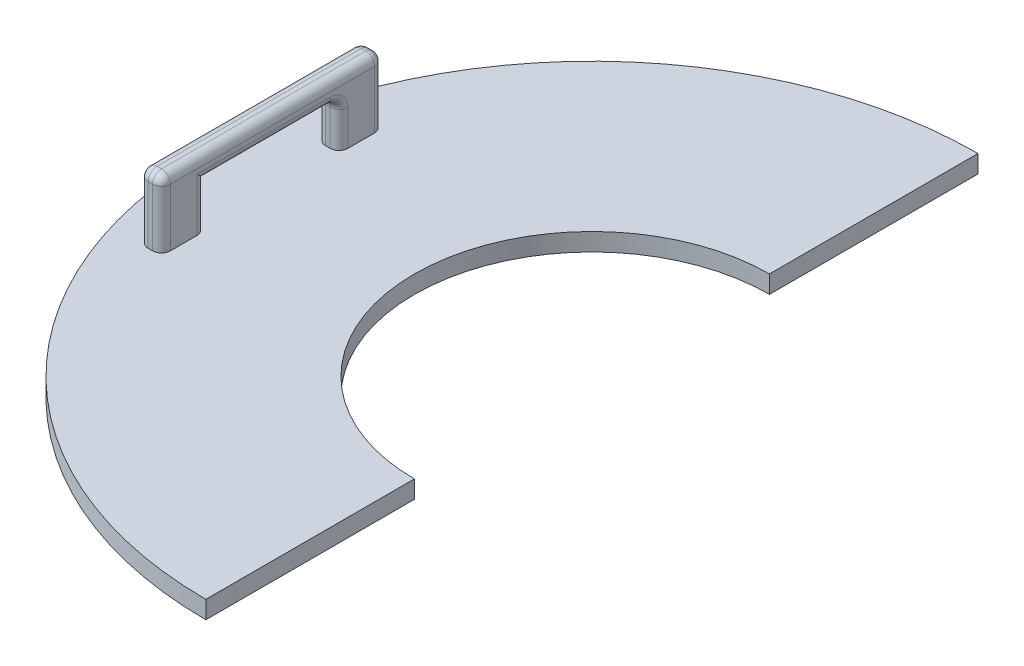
ISO-10303-21;
HEADER;
FILE_DESCRIPTION(('STEP AP214'),'2;1');
FILE_NAME('part.step','',(''),(''),'','','');
FILE_SCHEMA(('AUTOMOTIVE_DESIGN { 1 0 10303 214 1 1 1 1 }'));
ENDSEC;
DATA;
#1=APPLICATION_CONTEXT('core data for automotive mechanical design processes');
#2=APPLICATION_PROTOCOL_DEFINITION('international standard','automotive_design',2000,#1);
#3=PRODUCT_CONTEXT('',#1,'mechanical');
#4=PRODUCT('Part','Part','',(#3));
#5=PRODUCT_RELATED_PRODUCT_CATEGORY('part','',(#4));
#6=PRODUCT_DEFINITION_FORMATION('','',#4);
#7=PRODUCT_DEFINITION_CONTEXT('part definition',#1,'design');
#8=PRODUCT_DEFINITION('design','',#6,#7);
#9=PRODUCT_DEFINITION_SHAPE('','',#8);
#10=(LENGTH_UNIT() NAMED_UNIT(*) SI_UNIT(.MILLI.,.METRE.));
#11=(NAMED_UNIT(*) PLANE_ANGLE_UNIT() SI_UNIT($,.RADIAN.));
#12=(NAMED_UNIT(*) SI_UNIT($,.STERADIAN.) SOLID_ANGLE_UNIT());
#13=UNCERTAINTY_MEASURE_WITH_UNIT(LENGTH_MEASURE(1.E-05),#10,'distance_accuracy_value','');
#14=(GEOMETRIC_REPRESENTATION_CONTEXT(3) GLOBAL_UNCERTAINTY_ASSIGNED_CONTEXT((#13)) GLOBAL_UNIT_ASSIGNED_CONTEXT((#10,
#11,#12)) REPRESENTATION_CONTEXT('',''));
#15=CARTESIAN_POINT('',(0.,0.,0.));
#16=DIRECTION('',(0.,0.,1.));
#17=DIRECTION('',(1.,0.,0.));
#18=AXIS2_PLACEMENT_3D('',#15,#16,#17);
#19=CARTESIAN_POINT('',(-77.,19.,15.));
#20=DIRECTION('',(0.,0.,1.));
#21=DIRECTION('',(1.,0.,0.));
#22=AXIS2_PLACEMENT_3D('',#19,#20,#21);
#23=PLANE('',#22);
#24=DIRECTION('',(-1.,0.,0.));
#25=VECTOR('',#24,1.);
#26=CARTESIAN_POINT('',(-77.,4.,15.));
#27=LINE('',#26,#25);
#28=CARTESIAN_POINT('',(-74.,4.,15.));
#29=VERTEX_POINT('',#28);
#30=CARTESIAN_POINT('',(-75.,4.,15.));
#31=VERTEX_POINT('',#30);
#32=EDGE_CURVE('E417',#29,#31,#27,.T.);
#33=ORIENTED_EDGE('',*,*,#32,.T.);
#34=DIRECTION('',(0.,-1.,0.));
#35=VECTOR('',#34,1.);
#36=CARTESIAN_POINT('',(-75.,19.,15.));
#37=LINE('',#36,#35);
#38=CARTESIAN_POINT('',(-75.,14.,14.9999999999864));
#39=VERTEX_POINT('',#38);
#40=EDGE_CURVE('E273',#31,#39,#37,.F.);
#41=ORIENTED_EDGE('',*,*,#40,.T.);
#42=DIRECTION('',(1.,0.,0.));
#43=VECTOR('',#42,1.);
#44=CARTESIAN_POINT('',(-77.,14.,14.9999999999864));
#45=LINE('',#44,#43);
#46=CARTESIAN_POINT('',(-74.,14.,14.9999999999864));
#47=VERTEX_POINT('',#46);
#48=EDGE_CURVE('E330',#39,#47,#45,.T.);
#49=ORIENTED_EDGE('',*,*,#48,.T.);
#50=DIRECTION('',(0.,-1.,0.));
#51=VECTOR('',#50,1.);
#52=CARTESIAN_POINT('',(-74.,19.,15.));
#53=LINE('',#52,#51);
#54=EDGE_CURVE('E271',#47,#29,#53,.T.);
#55=ORIENTED_EDGE('',*,*,#54,.T.);
#56=EDGE_LOOP('',(#33,#41,#49,#55));
#57=FACE_BOUND('',#56,.T.);
#58=ADVANCED_FACE('F34',(#57),#23,.F.);
#59=CARTESIAN_POINT('',(-77.,19.,-15.));
#60=DIRECTION('',(0.,0.,-1.));
#61=DIRECTION('',(-1.,0.,0.));
#62=AXIS2_PLACEMENT_3D('',#59,#60,#61);
#63=PLANE('',#62);
#64=DIRECTION('',(1.,0.,0.));
#65=VECTOR('',#64,1.);
#66=CARTESIAN_POINT('',(-77.,12.,-15.));
#67=LINE('',#66,#65);
#68=CARTESIAN_POINT('',(-74.,12.,-15.));
#69=VERTEX_POINT('',#68);
#70=CARTESIAN_POINT('',(-75.,12.,-15.));
#71=VERTEX_POINT('',#70);
#72=EDGE_CURVE('E250',#69,#71,#67,.F.);
#73=ORIENTED_EDGE('',*,*,#72,.T.);
#74=DIRECTION('',(0.,-1.,0.));
#75=VECTOR('',#74,1.);
#76=CARTESIAN_POINT('',(-75.,19.,-15.));
#77=LINE('',#76,#75);
#78=CARTESIAN_POINT('',(-75.,4.,-15.));
#79=VERTEX_POINT('',#78);
#80=EDGE_CURVE('E254',#71,#79,#77,.T.);
#81=ORIENTED_EDGE('',*,*,#80,.T.);
#82=DIRECTION('',(1.,0.,0.));
#83=VECTOR('',#82,1.);
#84=CARTESIAN_POINT('',(-77.,4.,-15.));
#85=LINE('',#84,#83);
#86=CARTESIAN_POINT('',(-74.,4.,-15.));
#87=VERTEX_POINT('',#86);
#88=EDGE_CURVE('E408',#79,#87,#85,.T.);
#89=ORIENTED_EDGE('',*,*,#88,.T.);
#90=DIRECTION('',(0.,-1.,0.));
#91=VECTOR('',#90,1.);
#92=CARTESIAN_POINT('',(-74.,19.,-15.));
#93=LINE('',#92,#91);
#94=EDGE_CURVE('E252',#87,#69,#93,.F.);
#95=ORIENTED_EDGE('',*,*,#94,.T.);
#96=EDGE_LOOP('',(#73,#81,#89,#95));
#97=FACE_BOUND('',#96,.T.);
#98=ADVANCED_FACE('F448',(#97),#63,.F.);
#99=CARTESIAN_POINT('',(0.,4.,0.));
#100=DIRECTION('',(0.,1.,0.));
#101=DIRECTION('',(0.,0.,1.));
#102=AXIS2_PLACEMENT_3D('',#99,#100,#101);
#103=PLANE('',#102);
#104=CARTESIAN_POINT('',(0.,4.,0.));
#105=DIRECTION('',(0.,-1.,0.));
#106=DIRECTION('',(0.,0.,1.));
#107=AXIS2_PLACEMENT_3D('',#104,#105,#106);
#108=CIRCLE('',#107,40.);
#109=CARTESIAN_POINT('',(0.,4.,40.));
#110=VERTEX_POINT('',#109);
#111=CARTESIAN_POINT('',(0.,4.,-40.));
#112=VERTEX_POINT('',#111);
#113=EDGE_CURVE('E207',#110,#112,#108,.T.);
#114=ORIENTED_EDGE('',*,*,#113,.T.);
#115=DIRECTION('',(0.,0.,-1.));
#116=VECTOR('',#115,1.);
#117=CARTESIAN_POINT('',(0.,4.,-87.));
#118=LINE('',#117,#116);
#119=CARTESIAN_POINT('',(0.,4.,-87.));
#120=VERTEX_POINT('',#119);
#121=EDGE_CURVE('E196',#112,#120,#118,.T.);
#122=ORIENTED_EDGE('',*,*,#121,.T.);
#123=CARTESIAN_POINT('',(0.,4.,0.));
#124=DIRECTION('',(0.,1.,0.));
#125=DIRECTION('',(0.,0.,1.));
#126=AXIS2_PLACEMENT_3D('',#123,#124,#125);
#127=CIRCLE('',#126,87.);
#128=CARTESIAN_POINT('',(0.,4.,87.));
#129=VERTEX_POINT('',#128);
#130=EDGE_CURVE('E206',#120,#129,#127,.T.);
#131=ORIENTED_EDGE('',*,*,#130,.T.);
#132=DIRECTION('',(0.,0.,-1.));
#133=VECTOR('',#132,1.);
#134=CARTESIAN_POINT('',(0.,4.,40.));
#135=LINE('',#134,#133);
#136=EDGE_CURVE('E213',#129,#110,#135,.T.);
#137=ORIENTED_EDGE('',*,*,#136,.T.);
#138=EDGE_LOOP('',(#114,#122,#131,#137));
#139=FACE_BOUND('',#138,.T.);
#140=DIRECTION('',(1.,0.,0.));
#141=VECTOR('',#140,1.);
#142=CARTESIAN_POINT('',(-77.,4.,25.));
#143=LINE('',#142,#141);
#144=CARTESIAN_POINT('',(-75.,4.,25.));
#145=VERTEX_POINT('',#144);
#146=CARTESIAN_POINT('',(-74.,4.,25.));
#147=VERTEX_POINT('',#146);
#148=EDGE_CURVE('E405',#145,#147,#143,.T.);
#149=ORIENTED_EDGE('',*,*,#148,.F.);
#150=CARTESIAN_POINT('',(-75.,4.,23.));
#151=DIRECTION('',(0.,1.,0.));
#152=DIRECTION('',(0.,0.,1.));
#153=AXIS2_PLACEMENT_3D('',#150,#151,#152);
#154=CIRCLE('',#153,2.);
#155=CARTESIAN_POINT('',(-77.,4.,23.));
#156=VERTEX_POINT('',#155);
#157=EDGE_CURVE('E11',#145,#156,#154,.F.);
#158=ORIENTED_EDGE('',*,*,#157,.T.);
#159=DIRECTION('',(0.,0.,1.));
#160=VECTOR('',#159,1.);
#161=CARTESIAN_POINT('',(-77.,4.,25.));
#162=LINE('',#161,#160);
#163=CARTESIAN_POINT('',(-77.,4.,17.));
#164=VERTEX_POINT('',#163);
#165=EDGE_CURVE('E402',#164,#156,#162,.T.);
#166=ORIENTED_EDGE('',*,*,#165,.F.);
#167=CARTESIAN_POINT('',(-75.,4.,17.));
#168=DIRECTION('',(0.,1.,0.));
#169=DIRECTION('',(0.,0.,1.));
#170=AXIS2_PLACEMENT_3D('',#167,#168,#169);
#171=CIRCLE('',#170,2.);
#172=EDGE_CURVE('E296',#164,#31,#171,.F.);
#173=ORIENTED_EDGE('',*,*,#172,.T.);
#174=ORIENTED_EDGE('',*,*,#32,.F.);
#175=CARTESIAN_POINT('',(-74.,4.,17.));
#176=DIRECTION('',(0.,1.,0.));
#177=DIRECTION('',(0.,0.,1.));
#178=AXIS2_PLACEMENT_3D('',#175,#176,#177);
#179=CIRCLE('',#178,2.);
#180=CARTESIAN_POINT('',(-72.,4.,17.));
#181=VERTEX_POINT('',#180);
#182=EDGE_CURVE('E298',#29,#181,#179,.F.);
#183=ORIENTED_EDGE('',*,*,#182,.T.);
#184=DIRECTION('',(0.,0.,-1.));
#185=VECTOR('',#184,1.);
#186=CARTESIAN_POINT('',(-72.,4.,25.));
#187=LINE('',#186,#185);
#188=CARTESIAN_POINT('',(-72.,4.,23.));
#189=VERTEX_POINT('',#188);
#190=EDGE_CURVE('E414',#189,#181,#187,.T.);
#191=ORIENTED_EDGE('',*,*,#190,.F.);
#192=CARTESIAN_POINT('',(-74.,4.,23.));
#193=DIRECTION('',(0.,1.,0.));
#194=DIRECTION('',(0.,0.,1.));
#195=AXIS2_PLACEMENT_3D('',#192,#193,#194);
#196=CIRCLE('',#195,2.);
#197=EDGE_CURVE('E43',#189,#147,#196,.F.);
#198=ORIENTED_EDGE('',*,*,#197,.T.);
#199=EDGE_LOOP('',(#149,#158,#166,#173,#174,#183,#191,#198));
#200=FACE_BOUND('',#199,.T.);
#201=ORIENTED_EDGE('',*,*,#88,.F.);
#202=CARTESIAN_POINT('',(-75.,4.,-17.));
#203=DIRECTION('',(0.,1.,0.));
#204=DIRECTION('',(0.,0.,1.));
#205=AXIS2_PLACEMENT_3D('',#202,#203,#204);
#206=CIRCLE('',#205,2.);
#207=CARTESIAN_POINT('',(-77.,4.,-17.));
#208=VERTEX_POINT('',#207);
#209=EDGE_CURVE('E294',#79,#208,#206,.F.);
#210=ORIENTED_EDGE('',*,*,#209,.T.);
#211=DIRECTION('',(0.,0.,1.));
#212=VECTOR('',#211,1.);
#213=CARTESIAN_POINT('',(-77.,4.,-15.));
#214=LINE('',#213,#212);
#215=CARTESIAN_POINT('',(-77.,4.,-23.));
#216=VERTEX_POINT('',#215);
#217=EDGE_CURVE('E400',#216,#208,#214,.T.);
#218=ORIENTED_EDGE('',*,*,#217,.F.);
#219=CARTESIAN_POINT('',(-75.,4.,-23.));
#220=DIRECTION('',(0.,1.,0.));
#221=DIRECTION('',(0.,0.,1.));
#222=AXIS2_PLACEMENT_3D('',#219,#220,#221);
#223=CIRCLE('',#222,2.);
#224=CARTESIAN_POINT('',(-75.,4.,-25.));
#225=VERTEX_POINT('',#224);
#226=EDGE_CURVE('E304',#216,#225,#223,.F.);
#227=ORIENTED_EDGE('',*,*,#226,.T.);
#228=DIRECTION('',(-1.,0.,0.));
#229=VECTOR('',#228,1.);
#230=CARTESIAN_POINT('',(-77.,4.,-25.));
#231=LINE('',#230,#229);
#232=CARTESIAN_POINT('',(-74.,4.,-25.));
#233=VERTEX_POINT('',#232);
#234=EDGE_CURVE('E398',#233,#225,#231,.T.);
#235=ORIENTED_EDGE('',*,*,#234,.F.);
#236=CARTESIAN_POINT('',(-74.,4.,-23.));
#237=DIRECTION('',(0.,1.,0.));
#238=DIRECTION('',(0.,0.,1.));
#239=AXIS2_PLACEMENT_3D('',#236,#237,#238);
#240=CIRCLE('',#239,2.);
#241=CARTESIAN_POINT('',(-72.,4.,-23.));
#242=VERTEX_POINT('',#241);
#243=EDGE_CURVE('E302',#233,#242,#240,.F.);
#244=ORIENTED_EDGE('',*,*,#243,.T.);
#245=DIRECTION('',(0.,0.,-1.));
#246=VECTOR('',#245,1.);
#247=CARTESIAN_POINT('',(-72.,4.,-15.));
#248=LINE('',#247,#246);
#249=CARTESIAN_POINT('',(-72.,4.,-17.));
#250=VERTEX_POINT('',#249);
#251=EDGE_CURVE('E403',#250,#242,#248,.T.);
#252=ORIENTED_EDGE('',*,*,#251,.F.);
#253=CARTESIAN_POINT('',(-74.,4.,-17.));
#254=DIRECTION('',(0.,1.,0.));
#255=DIRECTION('',(0.,0.,1.));
#256=AXIS2_PLACEMENT_3D('',#253,#254,#255);
#257=CIRCLE('',#256,2.);
#258=EDGE_CURVE('E300',#250,#87,#257,.F.);
#259=ORIENTED_EDGE('',*,*,#258,.T.);
#260=EDGE_LOOP('',(#201,#210,#218,#227,#235,#244,#252,#259));
#261=FACE_BOUND('',#260,.T.);
#262=ADVANCED_FACE('F210',(#139,#200,#261),#103,.T.);
#263=CARTESIAN_POINT('',(0.,4.,0.));
#264=DIRECTION('',(0.,-1.,0.));
#265=DIRECTION('',(0.,0.,-1.));
#266=AXIS2_PLACEMENT_3D('',#263,#264,#265);
#267=CYLINDRICAL_SURFACE('',#266,40.);
#268=CARTESIAN_POINT('',(0.,0.,0.));
#269=DIRECTION('',(0.,-1.,0.));
#270=DIRECTION('',(0.,0.,1.));
#271=AXIS2_PLACEMENT_3D('',#268,#269,#270);
#272=CIRCLE('',#271,40.);
#273=CARTESIAN_POINT('',(0.,0.,40.));
#274=VERTEX_POINT('',#273);
#275=CARTESIAN_POINT('',(0.,0.,-40.));
#276=VERTEX_POINT('',#275);
#277=EDGE_CURVE('E221',#274,#276,#272,.T.);
#278=ORIENTED_EDGE('',*,*,#277,.T.);
#279=DIRECTION('',(0.,-1.,0.));
#280=VECTOR('',#279,1.);
#281=CARTESIAN_POINT('',(0.,4.,-40.));
#282=LINE('',#281,#280);
#283=EDGE_CURVE('E200',#112,#276,#282,.T.);
#284=ORIENTED_EDGE('',*,*,#283,.F.);
#285=ORIENTED_EDGE('',*,*,#113,.F.);
#286=DIRECTION('',(0.,-1.,0.));
#287=VECTOR('',#286,1.);
#288=CARTESIAN_POINT('',(0.,4.,40.));
#289=LINE('',#288,#287);
#290=EDGE_CURVE('E422',#110,#274,#289,.T.);
#291=ORIENTED_EDGE('',*,*,#290,.T.);
#292=EDGE_LOOP('',(#278,#284,#285,#291));
#293=FACE_BOUND('',#292,.T.);
#294=ADVANCED_FACE('F219',(#293),#267,.F.);
#295=CARTESIAN_POINT('',(0.,4.,-87.));
#296=DIRECTION('',(-1.,0.,0.));
#297=DIRECTION('',(0.,0.,1.));
#298=AXIS2_PLACEMENT_3D('',#295,#296,#297);
#299=PLANE('',#298);
#300=DIRECTION('',(0.,0.,-1.));
#301=VECTOR('',#300,1.);
#302=CARTESIAN_POINT('',(0.,0.,-87.));
#303=LINE('',#302,#301);
#304=CARTESIAN_POINT('',(0.,0.,-87.));
#305=VERTEX_POINT('',#304);
#306=EDGE_CURVE('E424',#276,#305,#303,.T.);
#307=ORIENTED_EDGE('',*,*,#306,.T.);
#308=DIRECTION('',(0.,-1.,0.));
#309=VECTOR('',#308,1.);
#310=CARTESIAN_POINT('',(0.,4.,-87.));
#311=LINE('',#310,#309);
#312=EDGE_CURVE('E203',#120,#305,#311,.T.);
#313=ORIENTED_EDGE('',*,*,#312,.F.);
#314=ORIENTED_EDGE('',*,*,#121,.F.);
#315=ORIENTED_EDGE('',*,*,#283,.T.);
#316=EDGE_LOOP('',(#307,#313,#314,#315));
#317=FACE_BOUND('',#316,.T.);
#318=ADVANCED_FACE('F198',(#317),#299,.F.);
#319=CARTESIAN_POINT('',(0.,4.,0.));
#320=DIRECTION('',(0.,-1.,0.));
#321=DIRECTION('',(0.,0.,-1.));
#322=AXIS2_PLACEMENT_3D('',#319,#320,#321);
#323=CYLINDRICAL_SURFACE('',#322,87.);
#324=CARTESIAN_POINT('',(0.,0.,0.));
#325=DIRECTION('',(0.,1.,0.));
#326=DIRECTION('',(0.,0.,1.));
#327=AXIS2_PLACEMENT_3D('',#324,#325,#326);
#328=CIRCLE('',#327,87.);
#329=CARTESIAN_POINT('',(0.,0.,87.));
#330=VERTEX_POINT('',#329);
#331=EDGE_CURVE('E426',#305,#330,#328,.T.);
#332=ORIENTED_EDGE('',*,*,#331,.T.);
#333=DIRECTION('',(0.,-1.,0.));
#334=VECTOR('',#333,1.);
#335=CARTESIAN_POINT('',(0.,4.,87.));
#336=LINE('',#335,#334);
#337=EDGE_CURVE('E226',#129,#330,#336,.T.);
#338=ORIENTED_EDGE('',*,*,#337,.F.);
#339=ORIENTED_EDGE('',*,*,#130,.F.);
#340=ORIENTED_EDGE('',*,*,#312,.T.);
#341=EDGE_LOOP('',(#332,#338,#339,#340));
#342=FACE_BOUND('',#341,.T.);
#343=ADVANCED_FACE('F438',(#342),#323,.T.);
#344=CARTESIAN_POINT('',(0.,4.,40.));
#345=DIRECTION('',(-1.,0.,0.));
#346=DIRECTION('',(0.,0.,1.));
#347=AXIS2_PLACEMENT_3D('',#344,#345,#346);
#348=PLANE('',#347);
#349=DIRECTION('',(0.,0.,-1.));
#350=VECTOR('',#349,1.);
#351=CARTESIAN_POINT('',(0.,0.,40.));
#352=LINE('',#351,#350);
#353=EDGE_CURVE('E217',#330,#274,#352,.T.);
#354=ORIENTED_EDGE('',*,*,#353,.T.);
#355=ORIENTED_EDGE('',*,*,#290,.F.);
#356=ORIENTED_EDGE('',*,*,#136,.F.);
#357=ORIENTED_EDGE('',*,*,#337,.T.);
#358=EDGE_LOOP('',(#354,#355,#356,#357));
#359=FACE_BOUND('',#358,.T.);
#360=ADVANCED_FACE('F433',(#359),#348,.F.);
#361=CARTESIAN_POINT('',(0.,0.,0.));
#362=DIRECTION('',(0.,1.,0.));
#363=DIRECTION('',(0.,0.,1.));
#364=AXIS2_PLACEMENT_3D('',#361,#362,#363);
#365=PLANE('',#364);
#366=ORIENTED_EDGE('',*,*,#277,.F.);
#367=ORIENTED_EDGE('',*,*,#353,.F.);
#368=ORIENTED_EDGE('',*,*,#331,.F.);
#369=ORIENTED_EDGE('',*,*,#306,.F.);
#370=EDGE_LOOP('',(#366,#367,#368,#369));
#371=FACE_BOUND('',#370,.T.);
#372=ADVANCED_FACE('F437',(#371),#365,.F.);
#373=CARTESIAN_POINT('',(-77.,19.,25.));
#374=DIRECTION('',(1.,0.,0.));
#375=DIRECTION('',(0.,0.,-1.));
#376=AXIS2_PLACEMENT_3D('',#373,#374,#375);
#377=PLANE('',#376);
#378=ORIENTED_EDGE('',*,*,#217,.T.);
#379=DIRECTION('',(0.,-1.,0.));
#380=VECTOR('',#379,1.);
#381=CARTESIAN_POINT('',(-77.,19.,-17.));
#382=LINE('',#381,#380);
#383=CARTESIAN_POINT('',(-77.,12.,-17.));
#384=VERTEX_POINT('',#383);
#385=EDGE_CURVE('E269',#208,#384,#382,.F.);
#386=ORIENTED_EDGE('',*,*,#385,.T.);
#387=CARTESIAN_POINT('',(-77.,12.,-12.9999999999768));
#388=DIRECTION('',(1.,0.,0.));
#389=DIRECTION('',(0.,0.,-1.));
#390=AXIS2_PLACEMENT_3D('',#387,#388,#389);
#391=CIRCLE('',#390,4.);
#392=CARTESIAN_POINT('',(-77.,16.,-12.9999999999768));
#393=VERTEX_POINT('',#392);
#394=EDGE_CURVE('E266',#393,#384,#391,.F.);
#395=ORIENTED_EDGE('',*,*,#394,.F.);
#396=DIRECTION('',(0.,0.,-1.));
#397=VECTOR('',#396,1.);
#398=CARTESIAN_POINT('',(-77.,16.,25.));
#399=LINE('',#398,#397);
#400=CARTESIAN_POINT('',(-77.,16.,17.));
#401=VERTEX_POINT('',#400);
#402=EDGE_CURVE('E262',#393,#401,#399,.F.);
#403=ORIENTED_EDGE('',*,*,#402,.T.);
#404=DIRECTION('',(0.,-1.,0.));
#405=VECTOR('',#404,1.);
#406=CARTESIAN_POINT('',(-77.,19.,17.));
#407=LINE('',#406,#405);
#408=EDGE_CURVE('E264',#401,#164,#407,.T.);
#409=ORIENTED_EDGE('',*,*,#408,.T.);
#410=ORIENTED_EDGE('',*,*,#165,.T.);
#411=DIRECTION('',(0.,-1.,0.));
#412=VECTOR('',#411,1.);
#413=CARTESIAN_POINT('',(-77.,19.,23.));
#414=LINE('',#413,#412);
#415=CARTESIAN_POINT('',(-77.,17.,23.));
#416=VERTEX_POINT('',#415);
#417=EDGE_CURVE('E256',#156,#416,#414,.F.);
#418=ORIENTED_EDGE('',*,*,#417,.T.);
#419=DIRECTION('',(0.,0.,1.));
#420=VECTOR('',#419,1.);
#421=CARTESIAN_POINT('',(-77.,17.,25.));
#422=LINE('',#421,#420);
#423=CARTESIAN_POINT('',(-77.,17.,-23.));
#424=VERTEX_POINT('',#423);
#425=EDGE_CURVE('E258',#416,#424,#422,.F.);
#426=ORIENTED_EDGE('',*,*,#425,.T.);
#427=DIRECTION('',(0.,-1.,0.));
#428=VECTOR('',#427,1.);
#429=CARTESIAN_POINT('',(-77.,19.,-23.));
#430=LINE('',#429,#428);
#431=EDGE_CURVE('E260',#424,#216,#430,.T.);
#432=ORIENTED_EDGE('',*,*,#431,.T.);
#433=EDGE_LOOP('',(#378,#386,#395,#403,#409,#410,#418,#426,#432));
#434=FACE_BOUND('',#433,.T.);
#435=ADVANCED_FACE('F388',(#434),#377,.F.);
#436=CARTESIAN_POINT('',(-77.,19.,25.));
#437=DIRECTION('',(0.,0.,-1.));
#438=DIRECTION('',(-1.,0.,0.));
#439=AXIS2_PLACEMENT_3D('',#436,#437,#438);
#440=PLANE('',#439);
#441=ORIENTED_EDGE('',*,*,#148,.T.);
#442=DIRECTION('',(0.,-1.,0.));
#443=VECTOR('',#442,1.);
#444=CARTESIAN_POINT('',(-74.,19.,25.));
#445=LINE('',#444,#443);
#446=CARTESIAN_POINT('',(-74.,17.,25.));
#447=VERTEX_POINT('',#446);
#448=EDGE_CURVE('E288',#147,#447,#445,.F.);
#449=ORIENTED_EDGE('',*,*,#448,.T.);
#450=DIRECTION('',(1.,0.,0.));
#451=VECTOR('',#450,1.);
#452=CARTESIAN_POINT('',(-77.,17.,25.));
#453=LINE('',#452,#451);
#454=CARTESIAN_POINT('',(-75.,17.,25.));
#455=VERTEX_POINT('',#454);
#456=EDGE_CURVE('E286',#447,#455,#453,.F.);
#457=ORIENTED_EDGE('',*,*,#456,.T.);
#458=DIRECTION('',(0.,-1.,0.));
#459=VECTOR('',#458,1.);
#460=CARTESIAN_POINT('',(-75.,19.,25.));
#461=LINE('',#460,#459);
#462=EDGE_CURVE('E284',#455,#145,#461,.T.);
#463=ORIENTED_EDGE('',*,*,#462,.T.);
#464=EDGE_LOOP('',(#441,#449,#457,#463));
#465=FACE_BOUND('',#464,.T.);
#466=ADVANCED_FACE('F461',(#465),#440,.F.);
#467=CARTESIAN_POINT('',(-72.,19.,25.));
#468=DIRECTION('',(-1.,0.,0.));
#469=DIRECTION('',(0.,0.,1.));
#470=AXIS2_PLACEMENT_3D('',#467,#468,#469);
#471=PLANE('',#470);
#472=ORIENTED_EDGE('',*,*,#190,.T.);
#473=DIRECTION('',(0.,-1.,0.));
#474=VECTOR('',#473,1.);
#475=CARTESIAN_POINT('',(-72.,19.,17.));
#476=LINE('',#475,#474);
#477=CARTESIAN_POINT('',(-72.,16.,17.));
#478=VERTEX_POINT('',#477);
#479=EDGE_CURVE('E242',#181,#478,#476,.F.);
#480=ORIENTED_EDGE('',*,*,#479,.T.);
#481=DIRECTION('',(0.,0.,-1.));
#482=VECTOR('',#481,1.);
#483=CARTESIAN_POINT('',(-72.,16.,25.));
#484=LINE('',#483,#482);
#485=CARTESIAN_POINT('',(-72.,16.,-12.9999999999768));
#486=VERTEX_POINT('',#485);
#487=EDGE_CURVE('E239',#478,#486,#484,.T.);
#488=ORIENTED_EDGE('',*,*,#487,.T.);
#489=CARTESIAN_POINT('',(-72.,12.,-12.9999999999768));
#490=DIRECTION('',(-1.,0.,0.));
#491=DIRECTION('',(0.,0.,1.));
#492=AXIS2_PLACEMENT_3D('',#489,#490,#491);
#493=CIRCLE('',#492,4.);
#494=CARTESIAN_POINT('',(-72.,12.,-17.));
#495=VERTEX_POINT('',#494);
#496=EDGE_CURVE('E236',#495,#486,#493,.F.);
#497=ORIENTED_EDGE('',*,*,#496,.F.);
#498=DIRECTION('',(0.,-1.,0.));
#499=VECTOR('',#498,1.);
#500=CARTESIAN_POINT('',(-72.,19.,-17.));
#501=LINE('',#500,#499);
#502=EDGE_CURVE('E234',#495,#250,#501,.T.);
#503=ORIENTED_EDGE('',*,*,#502,.T.);
#504=ORIENTED_EDGE('',*,*,#251,.T.);
#505=DIRECTION('',(0.,-1.,0.));
#506=VECTOR('',#505,1.);
#507=CARTESIAN_POINT('',(-72.,19.,-23.));
#508=LINE('',#507,#506);
#509=CARTESIAN_POINT('',(-72.,17.,-23.));
#510=VERTEX_POINT('',#509);
#511=EDGE_CURVE('E232',#242,#510,#508,.F.);
#512=ORIENTED_EDGE('',*,*,#511,.T.);
#513=DIRECTION('',(0.,0.,-1.));
#514=VECTOR('',#513,1.);
#515=CARTESIAN_POINT('',(-72.,17.,25.));
#516=LINE('',#515,#514);
#517=CARTESIAN_POINT('',(-72.,17.,23.));
#518=VERTEX_POINT('',#517);
#519=EDGE_CURVE('E224',#510,#518,#516,.F.);
#520=ORIENTED_EDGE('',*,*,#519,.T.);
#521=DIRECTION('',(0.,-1.,0.));
#522=VECTOR('',#521,1.);
#523=CARTESIAN_POINT('',(-72.,19.,23.));
#524=LINE('',#523,#522);
#525=EDGE_CURVE('E222',#518,#189,#524,.T.);
#526=ORIENTED_EDGE('',*,*,#525,.T.);
#527=EDGE_LOOP('',(#472,#480,#488,#497,#503,#504,#512,#520,#526));
#528=FACE_BOUND('',#527,.T.);
#529=ADVANCED_FACE('F458',(#528),#471,.F.);
#530=CARTESIAN_POINT('',(0.,19.,0.));
#531=DIRECTION('',(0.,-1.,0.));
#532=DIRECTION('',(0.,0.,-1.));
#533=AXIS2_PLACEMENT_3D('',#530,#531,#532);
#534=PLANE('',#533);
#535=DIRECTION('',(0.,0.,1.));
#536=VECTOR('',#535,1.);
#537=CARTESIAN_POINT('',(-75.,19.,0.));
#538=LINE('',#537,#536);
#539=CARTESIAN_POINT('',(-75.,19.,-23.));
#540=VERTEX_POINT('',#539);
#541=CARTESIAN_POINT('',(-75.,19.,23.));
#542=VERTEX_POINT('',#541);
#543=EDGE_CURVE('E277',#540,#542,#538,.T.);
#544=ORIENTED_EDGE('',*,*,#543,.T.);
#545=DIRECTION('',(1.,0.,0.));
#546=VECTOR('',#545,1.);
#547=CARTESIAN_POINT('',(0.,19.,23.));
#548=LINE('',#547,#546);
#549=CARTESIAN_POINT('',(-74.,19.,23.));
#550=VERTEX_POINT('',#549);
#551=EDGE_CURVE('E282',#542,#550,#548,.T.);
#552=ORIENTED_EDGE('',*,*,#551,.T.);
#553=DIRECTION('',(0.,0.,-1.));
#554=VECTOR('',#553,1.);
#555=CARTESIAN_POINT('',(-74.,19.,0.));
#556=LINE('',#555,#554);
#557=CARTESIAN_POINT('',(-74.,19.,-23.));
#558=VERTEX_POINT('',#557);
#559=EDGE_CURVE('E279',#550,#558,#556,.T.);
#560=ORIENTED_EDGE('',*,*,#559,.T.);
#561=DIRECTION('',(-1.,0.,0.));
#562=VECTOR('',#561,1.);
#563=CARTESIAN_POINT('',(0.,19.,-23.));
#564=LINE('',#563,#562);
#565=EDGE_CURVE('E275',#558,#540,#564,.T.);
#566=ORIENTED_EDGE('',*,*,#565,.T.);
#567=EDGE_LOOP('',(#544,#552,#560,#566));
#568=FACE_BOUND('',#567,.T.);
#569=ADVANCED_FACE('F377',(#568),#534,.F.);
#570=CARTESIAN_POINT('',(-77.,19.,-25.));
#571=DIRECTION('',(0.,0.,1.));
#572=DIRECTION('',(1.,0.,0.));
#573=AXIS2_PLACEMENT_3D('',#570,#571,#572);
#574=PLANE('',#573);
#575=DIRECTION('',(-1.,0.,0.));
#576=VECTOR('',#575,1.);
#577=CARTESIAN_POINT('',(-77.,17.,-25.));
#578=LINE('',#577,#576);
#579=CARTESIAN_POINT('',(-75.,17.,-25.));
#580=VERTEX_POINT('',#579);
#581=CARTESIAN_POINT('',(-74.,17.,-25.));
#582=VERTEX_POINT('',#581);
#583=EDGE_CURVE('E51',#580,#582,#578,.F.);
#584=ORIENTED_EDGE('',*,*,#583,.T.);
#585=DIRECTION('',(0.,-1.,0.));
#586=VECTOR('',#585,1.);
#587=CARTESIAN_POINT('',(-74.,19.,-25.));
#588=LINE('',#587,#586);
#589=EDGE_CURVE('E292',#582,#233,#588,.T.);
#590=ORIENTED_EDGE('',*,*,#589,.T.);
#591=ORIENTED_EDGE('',*,*,#234,.T.);
#592=DIRECTION('',(0.,-1.,0.));
#593=VECTOR('',#592,1.);
#594=CARTESIAN_POINT('',(-75.,19.,-25.));
#595=LINE('',#594,#593);
#596=EDGE_CURVE('E56',#225,#580,#595,.F.);
#597=ORIENTED_EDGE('',*,*,#596,.T.);
#598=EDGE_LOOP('',(#584,#590,#591,#597));
#599=FACE_BOUND('',#598,.T.);
#600=ADVANCED_FACE('F401',(#599),#574,.F.);
#601=CARTESIAN_POINT('',(-77.,14.,500000.));
#602=DIRECTION('',(0.,1.,0.));
#603=DIRECTION('',(0.,0.,1.));
#604=AXIS2_PLACEMENT_3D('',#601,#602,#603);
#605=PLANE('',#604);
#606=DIRECTION('',(1.,0.,0.));
#607=VECTOR('',#606,1.);
#608=CARTESIAN_POINT('',(-72.,14.,-12.9999999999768));
#609=LINE('',#608,#607);
#610=CARTESIAN_POINT('',(-75.,14.,-12.9999999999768));
#611=VERTEX_POINT('',#610);
#612=CARTESIAN_POINT('',(-74.,14.,-12.9999999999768));
#613=VERTEX_POINT('',#612);
#614=EDGE_CURVE('E246',#611,#613,#609,.T.);
#615=ORIENTED_EDGE('',*,*,#614,.T.);
#616=DIRECTION('',(0.,0.,-1.));
#617=VECTOR('',#616,1.);
#618=CARTESIAN_POINT('',(-74.,14.,500000.));
#619=LINE('',#618,#617);
#620=EDGE_CURVE('E248',#613,#47,#619,.F.);
#621=ORIENTED_EDGE('',*,*,#620,.T.);
#622=ORIENTED_EDGE('',*,*,#48,.F.);
#623=DIRECTION('',(0.,0.,-1.));
#624=VECTOR('',#623,1.);
#625=CARTESIAN_POINT('',(-75.,14.,500000.));
#626=LINE('',#625,#624);
#627=EDGE_CURVE('E244',#39,#611,#626,.T.);
#628=ORIENTED_EDGE('',*,*,#627,.T.);
#629=EDGE_LOOP('',(#615,#621,#622,#628));
#630=FACE_BOUND('',#629,.T.);
#631=ADVANCED_FACE('F499',(#630),#605,.F.);
#632=CARTESIAN_POINT('',(-75.,19.,17.));
#633=DIRECTION('',(0.,-1.,0.));
#634=DIRECTION('',(0.,0.,-1.));
#635=AXIS2_PLACEMENT_3D('',#632,#633,#634);
#636=CYLINDRICAL_SURFACE('',#635,2.);
#637=ORIENTED_EDGE('',*,*,#172,.F.);
#638=ORIENTED_EDGE('',*,*,#408,.F.);
#639=CARTESIAN_POINT('',(-75.,16.,16.999999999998));
#640=DIRECTION('',(0.,-0.707106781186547,0.707106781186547));
#641=DIRECTION('',(0.,-0.707106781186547,-0.707106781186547));
#642=AXIS2_PLACEMENT_3D('',#639,#640,#641);
#643=ELLIPSE('',#642,2.82842712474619,2.);
#644=EDGE_CURVE('E327',#39,#401,#643,.F.);
#645=ORIENTED_EDGE('',*,*,#644,.F.);
#646=ORIENTED_EDGE('',*,*,#40,.F.);
#647=EDGE_LOOP('',(#637,#638,#645,#646));
#648=FACE_BOUND('',#647,.T.);
#649=ADVANCED_FACE('F506',(#648),#636,.T.);
#650=CARTESIAN_POINT('',(-75.,19.,-17.));
#651=DIRECTION('',(0.,-1.,0.));
#652=DIRECTION('',(0.,0.,-1.));
#653=AXIS2_PLACEMENT_3D('',#650,#651,#652);
#654=CYLINDRICAL_SURFACE('',#653,2.);
#655=ORIENTED_EDGE('',*,*,#209,.F.);
#656=ORIENTED_EDGE('',*,*,#80,.F.);
#657=CARTESIAN_POINT('',(-75.,12.,-17.));
#658=DIRECTION('',(0.,1.,0.));
#659=DIRECTION('',(0.,0.,1.));
#660=AXIS2_PLACEMENT_3D('',#657,#658,#659);
#661=CIRCLE('',#660,2.);
#662=EDGE_CURVE('E324',#384,#71,#661,.T.);
#663=ORIENTED_EDGE('',*,*,#662,.F.);
#664=ORIENTED_EDGE('',*,*,#385,.F.);
#665=EDGE_LOOP('',(#655,#656,#663,#664));
#666=FACE_BOUND('',#665,.T.);
#667=ADVANCED_FACE('F514',(#666),#654,.T.);
#668=CARTESIAN_POINT('',(-75.,16.,500000.));
#669=DIRECTION('',(0.,0.,-1.));
#670=DIRECTION('',(-1.,0.,0.));
#671=AXIS2_PLACEMENT_3D('',#668,#669,#670);
#672=CYLINDRICAL_SURFACE('',#671,2.);
#673=ORIENTED_EDGE('',*,*,#644,.T.);
#674=ORIENTED_EDGE('',*,*,#402,.F.);
#675=CARTESIAN_POINT('',(-75.,16.,-12.9999999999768));
#676=DIRECTION('',(0.,0.,-1.));
#677=DIRECTION('',(-1.,0.,0.));
#678=AXIS2_PLACEMENT_3D('',#675,#676,#677);
#679=CIRCLE('',#678,2.);
#680=EDGE_CURVE('E321',#611,#393,#679,.T.);
#681=ORIENTED_EDGE('',*,*,#680,.F.);
#682=ORIENTED_EDGE('',*,*,#627,.F.);
#683=EDGE_LOOP('',(#673,#674,#681,#682));
#684=FACE_BOUND('',#683,.T.);
#685=ADVANCED_FACE('F522',(#684),#672,.T.);
#686=CARTESIAN_POINT('',(-75.,12.,-12.9999999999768));
#687=DIRECTION('',(1.,0.,0.));
#688=DIRECTION('',(0.,0.,-1.));
#689=AXIS2_PLACEMENT_3D('',#686,#687,#688);
#690=TOROIDAL_SURFACE('',#689,4.,2.);
#691=ORIENTED_EDGE('',*,*,#394,.T.);
#692=ORIENTED_EDGE('',*,*,#662,.T.);
#693=CARTESIAN_POINT('',(-75.,12.,-12.9999999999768));
#694=DIRECTION('',(1.,0.,0.));
#695=DIRECTION('',(0.,0.,-1.));
#696=AXIS2_PLACEMENT_3D('',#693,#694,#695);
#697=CIRCLE('',#696,2.);
#698=EDGE_CURVE('E318',#611,#71,#697,.F.);
#699=ORIENTED_EDGE('',*,*,#698,.F.);
#700=ORIENTED_EDGE('',*,*,#680,.T.);
#701=EDGE_LOOP('',(#691,#692,#699,#700));
#702=FACE_BOUND('',#701,.T.);
#703=ADVANCED_FACE('F530',(#702),#690,.T.);
#704=CARTESIAN_POINT('',(-74.,19.,-17.));
#705=DIRECTION('',(0.,-1.,0.));
#706=DIRECTION('',(0.,0.,-1.));
#707=AXIS2_PLACEMENT_3D('',#704,#705,#706);
#708=CYLINDRICAL_SURFACE('',#707,2.);
#709=ORIENTED_EDGE('',*,*,#258,.F.);
#710=ORIENTED_EDGE('',*,*,#502,.F.);
#711=CARTESIAN_POINT('',(-74.,12.,-17.));
#712=DIRECTION('',(0.,1.,0.));
#713=DIRECTION('',(0.,0.,1.));
#714=AXIS2_PLACEMENT_3D('',#711,#712,#713);
#715=CIRCLE('',#714,2.);
#716=EDGE_CURVE('E315',#69,#495,#715,.T.);
#717=ORIENTED_EDGE('',*,*,#716,.F.);
#718=ORIENTED_EDGE('',*,*,#94,.F.);
#719=EDGE_LOOP('',(#709,#710,#717,#718));
#720=FACE_BOUND('',#719,.T.);
#721=ADVANCED_FACE('F538',(#720),#708,.T.);
#722=CARTESIAN_POINT('',(-77.,12.,-12.9999999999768));
#723=DIRECTION('',(-1.,0.,0.));
#724=DIRECTION('',(0.,0.,1.));
#725=AXIS2_PLACEMENT_3D('',#722,#723,#724);
#726=CYLINDRICAL_SURFACE('',#725,2.);
#727=ORIENTED_EDGE('',*,*,#698,.T.);
#728=ORIENTED_EDGE('',*,*,#72,.F.);
#729=CARTESIAN_POINT('',(-74.,12.,-12.9999999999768));
#730=DIRECTION('',(-1.,0.,0.));
#731=DIRECTION('',(0.,0.,1.));
#732=AXIS2_PLACEMENT_3D('',#729,#730,#731);
#733=CIRCLE('',#732,2.);
#734=EDGE_CURVE('E312',#613,#69,#733,.T.);
#735=ORIENTED_EDGE('',*,*,#734,.F.);
#736=ORIENTED_EDGE('',*,*,#614,.F.);
#737=EDGE_LOOP('',(#727,#728,#735,#736));
#738=FACE_BOUND('',#737,.T.);
#739=ADVANCED_FACE('F546',(#738),#726,.F.);
#740=CARTESIAN_POINT('',(-74.,19.,17.));
#741=DIRECTION('',(0.,-1.,0.));
#742=DIRECTION('',(0.,0.,-1.));
#743=AXIS2_PLACEMENT_3D('',#740,#741,#742);
#744=CYLINDRICAL_SURFACE('',#743,2.);
#745=ORIENTED_EDGE('',*,*,#182,.F.);
#746=ORIENTED_EDGE('',*,*,#54,.F.);
#747=CARTESIAN_POINT('',(-74.,16.,17.));
#748=DIRECTION('',(0.,0.707106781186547,-0.707106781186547));
#749=DIRECTION('',(0.,-0.707106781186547,-0.707106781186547));
#750=AXIS2_PLACEMENT_3D('',#747,#748,#749);
#751=ELLIPSE('',#750,2.82842712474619,2.);
#752=EDGE_CURVE('E309',#478,#47,#751,.T.);
#753=ORIENTED_EDGE('',*,*,#752,.F.);
#754=ORIENTED_EDGE('',*,*,#479,.F.);
#755=EDGE_LOOP('',(#745,#746,#753,#754));
#756=FACE_BOUND('',#755,.T.);
#757=ADVANCED_FACE('F554',(#756),#744,.T.);
#758=CARTESIAN_POINT('',(-74.,12.,-12.9999999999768));
#759=DIRECTION('',(-1.,0.,0.));
#760=DIRECTION('',(0.,0.,1.));
#761=AXIS2_PLACEMENT_3D('',#758,#759,#760);
#762=TOROIDAL_SURFACE('',#761,4.,2.);
#763=ORIENTED_EDGE('',*,*,#716,.T.);
#764=ORIENTED_EDGE('',*,*,#496,.T.);
#765=CARTESIAN_POINT('',(-74.,16.,-12.9999999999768));
#766=DIRECTION('',(0.,0.,-1.));
#767=DIRECTION('',(-1.,0.,0.));
#768=AXIS2_PLACEMENT_3D('',#765,#766,#767);
#769=CIRCLE('',#768,2.);
#770=EDGE_CURVE('E307',#613,#486,#769,.F.);
#771=ORIENTED_EDGE('',*,*,#770,.F.);
#772=ORIENTED_EDGE('',*,*,#734,.T.);
#773=EDGE_LOOP('',(#763,#764,#771,#772));
#774=FACE_BOUND('',#773,.T.);
#775=ADVANCED_FACE('F562',(#774),#762,.T.);
#776=CARTESIAN_POINT('',(-74.,16.,25.));
#777=DIRECTION('',(0.,0.,-1.));
#778=DIRECTION('',(-1.,0.,0.));
#779=AXIS2_PLACEMENT_3D('',#776,#777,#778);
#780=CYLINDRICAL_SURFACE('',#779,2.);
#781=ORIENTED_EDGE('',*,*,#752,.T.);
#782=ORIENTED_EDGE('',*,*,#620,.F.);
#783=ORIENTED_EDGE('',*,*,#770,.T.);
#784=ORIENTED_EDGE('',*,*,#487,.F.);
#785=EDGE_LOOP('',(#781,#782,#783,#784));
#786=FACE_BOUND('',#785,.T.);
#787=ADVANCED_FACE('F570',(#786),#780,.T.);
#788=CARTESIAN_POINT('',(-75.,19.,23.));
#789=DIRECTION('',(0.,-1.,0.));
#790=DIRECTION('',(0.,0.,-1.));
#791=AXIS2_PLACEMENT_3D('',#788,#789,#790);
#792=CYLINDRICAL_SURFACE('',#791,2.);
#793=ORIENTED_EDGE('',*,*,#157,.F.);
#794=ORIENTED_EDGE('',*,*,#462,.F.);
#795=CARTESIAN_POINT('',(-75.,17.,23.));
#796=DIRECTION('',(0.,1.,0.));
#797=DIRECTION('',(0.,0.,1.));
#798=AXIS2_PLACEMENT_3D('',#795,#796,#797);
#799=CIRCLE('',#798,2.);
#800=EDGE_CURVE('E38',#416,#455,#799,.T.);
#801=ORIENTED_EDGE('',*,*,#800,.F.);
#802=ORIENTED_EDGE('',*,*,#417,.F.);
#803=EDGE_LOOP('',(#793,#794,#801,#802));
#804=FACE_BOUND('',#803,.T.);
#805=ADVANCED_FACE('F36',(#804),#792,.T.);
#806=CARTESIAN_POINT('',(-75.,17.,0.));
#807=DIRECTION('',(0.,0.,1.));
#808=DIRECTION('',(1.,0.,0.));
#809=AXIS2_PLACEMENT_3D('',#806,#807,#808);
#810=CYLINDRICAL_SURFACE('',#809,2.);
#811=CARTESIAN_POINT('',(-75.,17.,-23.));
#812=DIRECTION('',(0.,0.,-1.));
#813=DIRECTION('',(-1.,0.,0.));
#814=AXIS2_PLACEMENT_3D('',#811,#812,#813);
#815=CIRCLE('',#814,2.);
#816=EDGE_CURVE('E356',#424,#540,#815,.T.);
#817=ORIENTED_EDGE('',*,*,#816,.F.);
#818=ORIENTED_EDGE('',*,*,#425,.F.);
#819=CARTESIAN_POINT('',(-75.,17.,23.));
#820=DIRECTION('',(0.,0.,1.));
#821=DIRECTION('',(1.,0.,0.));
#822=AXIS2_PLACEMENT_3D('',#819,#820,#821);
#823=CIRCLE('',#822,2.);
#824=EDGE_CURVE('E358',#542,#416,#823,.T.);
#825=ORIENTED_EDGE('',*,*,#824,.F.);
#826=ORIENTED_EDGE('',*,*,#543,.F.);
#827=EDGE_LOOP('',(#817,#818,#825,#826));
#828=FACE_BOUND('',#827,.T.);
#829=ADVANCED_FACE('F384',(#828),#810,.T.);
#830=CARTESIAN_POINT('',(-75.,19.,-23.));
#831=DIRECTION('',(0.,-1.,0.));
#832=DIRECTION('',(0.,0.,-1.));
#833=AXIS2_PLACEMENT_3D('',#830,#831,#832);
#834=CYLINDRICAL_SURFACE('',#833,2.);
#835=ORIENTED_EDGE('',*,*,#226,.F.);
#836=ORIENTED_EDGE('',*,*,#431,.F.);
#837=CARTESIAN_POINT('',(-75.,17.,-23.));
#838=DIRECTION('',(0.,1.,0.));
#839=DIRECTION('',(0.,0.,1.));
#840=AXIS2_PLACEMENT_3D('',#837,#838,#839);
#841=CIRCLE('',#840,2.);
#842=EDGE_CURVE('E353',#580,#424,#841,.T.);
#843=ORIENTED_EDGE('',*,*,#842,.F.);
#844=ORIENTED_EDGE('',*,*,#596,.F.);
#845=EDGE_LOOP('',(#835,#836,#843,#844));
#846=FACE_BOUND('',#845,.T.);
#847=ADVANCED_FACE('F393',(#846),#834,.T.);
#848=CARTESIAN_POINT('',(-75.,17.,23.));
#849=DIRECTION('',(0.,0.,1.));
#850=DIRECTION('',(1.,0.,0.));
#851=AXIS2_PLACEMENT_3D('',#848,#849,#850);
#852=SPHERICAL_SURFACE('',#851,2.);
#853=ORIENTED_EDGE('',*,*,#824,.T.);
#854=ORIENTED_EDGE('',*,*,#800,.T.);
#855=CARTESIAN_POINT('',(-75.,17.,23.));
#856=DIRECTION('',(-1.,0.,0.));
#857=DIRECTION('',(0.,0.,1.));
#858=AXIS2_PLACEMENT_3D('',#855,#856,#857);
#859=CIRCLE('',#858,2.);
#860=EDGE_CURVE('E350',#542,#455,#859,.F.);
#861=ORIENTED_EDGE('',*,*,#860,.F.);
#862=EDGE_LOOP('',(#853,#854,#861));
#863=FACE_BOUND('',#862,.T.);
#864=ADVANCED_FACE('F365',(#863),#852,.T.);
#865=CARTESIAN_POINT('',(-75.,17.,-23.));
#866=DIRECTION('',(0.,0.,1.));
#867=DIRECTION('',(1.,0.,0.));
#868=AXIS2_PLACEMENT_3D('',#865,#866,#867);
#869=SPHERICAL_SURFACE('',#868,2.);
#870=ORIENTED_EDGE('',*,*,#842,.T.);
#871=ORIENTED_EDGE('',*,*,#816,.T.);
#872=CARTESIAN_POINT('',(-75.,17.,-23.));
#873=DIRECTION('',(-1.,0.,0.));
#874=DIRECTION('',(0.,0.,1.));
#875=AXIS2_PLACEMENT_3D('',#872,#873,#874);
#876=CIRCLE('',#875,2.);
#877=EDGE_CURVE('E347',#580,#540,#876,.F.);
#878=ORIENTED_EDGE('',*,*,#877,.F.);
#879=EDGE_LOOP('',(#870,#871,#878));
#880=FACE_BOUND('',#879,.T.);
#881=ADVANCED_FACE('F601',(#880),#869,.T.);
#882=CARTESIAN_POINT('',(-74.,19.,23.));
#883=DIRECTION('',(0.,-1.,0.));
#884=DIRECTION('',(0.,0.,-1.));
#885=AXIS2_PLACEMENT_3D('',#882,#883,#884);
#886=CYLINDRICAL_SURFACE('',#885,2.);
#887=ORIENTED_EDGE('',*,*,#197,.F.);
#888=ORIENTED_EDGE('',*,*,#525,.F.);
#889=CARTESIAN_POINT('',(-74.,17.,23.));
#890=DIRECTION('',(0.,1.,0.));
#891=DIRECTION('',(0.,0.,1.));
#892=AXIS2_PLACEMENT_3D('',#889,#890,#891);
#893=CIRCLE('',#892,2.);
#894=EDGE_CURVE('E344',#447,#518,#893,.T.);
#895=ORIENTED_EDGE('',*,*,#894,.F.);
#896=ORIENTED_EDGE('',*,*,#448,.F.);
#897=EDGE_LOOP('',(#887,#888,#895,#896));
#898=FACE_BOUND('',#897,.T.);
#899=ADVANCED_FACE('F608',(#898),#886,.T.);
#900=CARTESIAN_POINT('',(0.,17.,23.));
#901=DIRECTION('',(1.,0.,0.));
#902=DIRECTION('',(0.,0.,-1.));
#903=AXIS2_PLACEMENT_3D('',#900,#901,#902);
#904=CYLINDRICAL_SURFACE('',#903,2.);
#905=ORIENTED_EDGE('',*,*,#860,.T.);
#906=ORIENTED_EDGE('',*,*,#456,.F.);
#907=CARTESIAN_POINT('',(-74.,17.,23.));
#908=DIRECTION('',(1.,0.,0.));
#909=DIRECTION('',(0.,0.,-1.));
#910=AXIS2_PLACEMENT_3D('',#907,#908,#909);
#911=CIRCLE('',#910,2.);
#912=EDGE_CURVE('E341',#550,#447,#911,.T.);
#913=ORIENTED_EDGE('',*,*,#912,.F.);
#914=ORIENTED_EDGE('',*,*,#551,.F.);
#915=EDGE_LOOP('',(#905,#906,#913,#914));
#916=FACE_BOUND('',#915,.T.);
#917=ADVANCED_FACE('F372',(#916),#904,.T.);
#918=CARTESIAN_POINT('',(0.,17.,-23.));
#919=DIRECTION('',(-1.,0.,0.));
#920=DIRECTION('',(0.,0.,1.));
#921=AXIS2_PLACEMENT_3D('',#918,#919,#920);
#922=CYLINDRICAL_SURFACE('',#921,2.);
#923=ORIENTED_EDGE('',*,*,#877,.T.);
#924=ORIENTED_EDGE('',*,*,#565,.F.);
#925=CARTESIAN_POINT('',(-74.,17.,-23.));
#926=DIRECTION('',(1.,0.,0.));
#927=DIRECTION('',(0.,0.,-1.));
#928=AXIS2_PLACEMENT_3D('',#925,#926,#927);
#929=CIRCLE('',#928,2.);
#930=EDGE_CURVE('E338',#582,#558,#929,.T.);
#931=ORIENTED_EDGE('',*,*,#930,.F.);
#932=ORIENTED_EDGE('',*,*,#583,.F.);
#933=EDGE_LOOP('',(#923,#924,#931,#932));
#934=FACE_BOUND('',#933,.T.);
#935=ADVANCED_FACE('F623',(#934),#922,.T.);
#936=CARTESIAN_POINT('',(-74.,19.,-23.));
#937=DIRECTION('',(0.,-1.,0.));
#938=DIRECTION('',(0.,0.,-1.));
#939=AXIS2_PLACEMENT_3D('',#936,#937,#938);
#940=CYLINDRICAL_SURFACE('',#939,2.);
#941=ORIENTED_EDGE('',*,*,#243,.F.);
#942=ORIENTED_EDGE('',*,*,#589,.F.);
#943=CARTESIAN_POINT('',(-74.,17.,-23.));
#944=DIRECTION('',(0.,1.,0.));
#945=DIRECTION('',(0.,0.,1.));
#946=AXIS2_PLACEMENT_3D('',#943,#944,#945);
#947=CIRCLE('',#946,2.);
#948=EDGE_CURVE('E335',#510,#582,#947,.T.);
#949=ORIENTED_EDGE('',*,*,#948,.F.);
#950=ORIENTED_EDGE('',*,*,#511,.F.);
#951=EDGE_LOOP('',(#941,#942,#949,#950));
#952=FACE_BOUND('',#951,.T.);
#953=ADVANCED_FACE('F630',(#952),#940,.T.);
#954=CARTESIAN_POINT('',(-74.,17.,23.));
#955=DIRECTION('',(0.,0.,1.));
#956=DIRECTION('',(1.,0.,0.));
#957=AXIS2_PLACEMENT_3D('',#954,#955,#956);
#958=SPHERICAL_SURFACE('',#957,2.);
#959=ORIENTED_EDGE('',*,*,#912,.T.);
#960=ORIENTED_EDGE('',*,*,#894,.T.);
#961=CARTESIAN_POINT('',(-74.,17.,23.));
#962=DIRECTION('',(0.,0.,1.));
#963=DIRECTION('',(1.,0.,0.));
#964=AXIS2_PLACEMENT_3D('',#961,#962,#963);
#965=CIRCLE('',#964,2.);
#966=EDGE_CURVE('E333',#550,#518,#965,.F.);
#967=ORIENTED_EDGE('',*,*,#966,.F.);
#968=EDGE_LOOP('',(#959,#960,#967));
#969=FACE_BOUND('',#968,.T.);
#970=ADVANCED_FACE('F638',(#969),#958,.T.);
#971=CARTESIAN_POINT('',(-74.,17.,-23.));
#972=DIRECTION('',(0.,0.,1.));
#973=DIRECTION('',(1.,0.,0.));
#974=AXIS2_PLACEMENT_3D('',#971,#972,#973);
#975=SPHERICAL_SURFACE('',#974,2.);
#976=ORIENTED_EDGE('',*,*,#948,.T.);
#977=ORIENTED_EDGE('',*,*,#930,.T.);
#978=CARTESIAN_POINT('',(-74.,17.,-23.));
#979=DIRECTION('',(0.,0.,-1.));
#980=DIRECTION('',(-1.,0.,0.));
#981=AXIS2_PLACEMENT_3D('',#978,#979,#980);
#982=CIRCLE('',#981,2.);
#983=EDGE_CURVE('E331',#510,#558,#982,.F.);
#984=ORIENTED_EDGE('',*,*,#983,.F.);
#985=EDGE_LOOP('',(#976,#977,#984));
#986=FACE_BOUND('',#985,.T.);
#987=ADVANCED_FACE('F646',(#986),#975,.T.);
#988=CARTESIAN_POINT('',(-74.,17.,0.));
#989=DIRECTION('',(0.,0.,-1.));
#990=DIRECTION('',(-1.,0.,0.));
#991=AXIS2_PLACEMENT_3D('',#988,#989,#990);
#992=CYLINDRICAL_SURFACE('',#991,2.);
#993=ORIENTED_EDGE('',*,*,#966,.T.);
#994=ORIENTED_EDGE('',*,*,#519,.F.);
#995=ORIENTED_EDGE('',*,*,#983,.T.);
#996=ORIENTED_EDGE('',*,*,#559,.F.);
#997=EDGE_LOOP('',(#993,#994,#995,#996));
#998=FACE_BOUND('',#997,.T.);
#999=ADVANCED_FACE('F654',(#998),#992,.T.);
#1000=CLOSED_SHELL('',(#58,#98,#262,#294,#318,#343,#360,#372,#435,#466,#529,#569,#600,#631,#649,
#667,#685,#703,#721,#739,#757,#775,#787,#805,#829,#847,#864,#881,#899,#917,#935,#953,#970,#987,#999));
#1001=MANIFOLD_SOLID_BREP('B2',#1000);
#1002=ADVANCED_BREP_SHAPE_REPRESENTATION('',(#18,#1001),#14);
#1003=SHAPE_DEFINITION_REPRESENTATION(#9,#1002);
ENDSEC;
END-ISO-10303-21;
